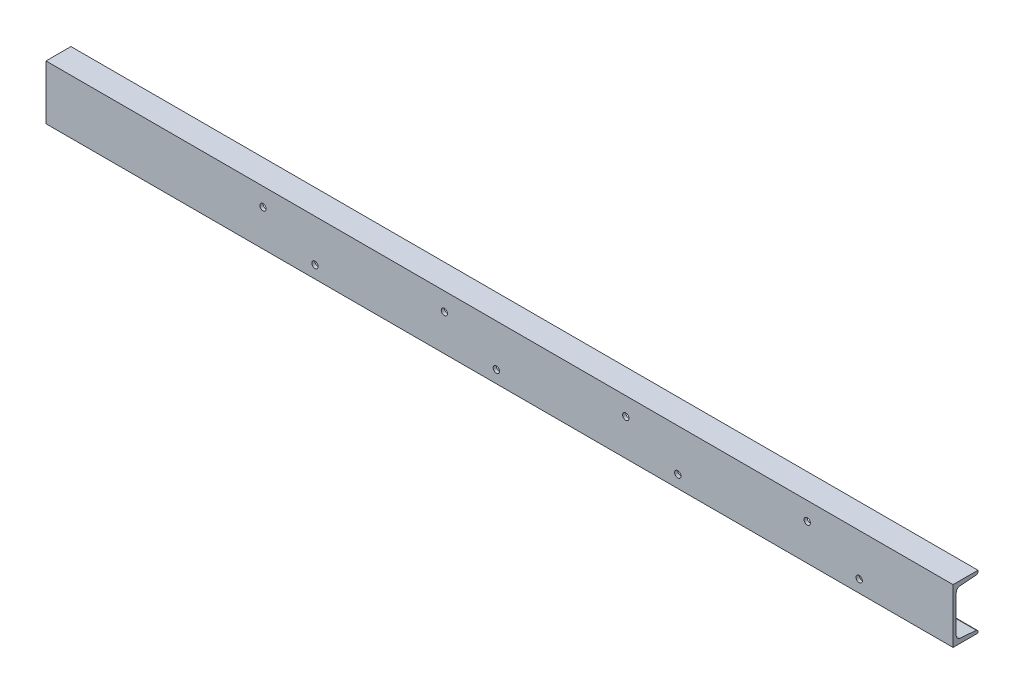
ISO-10303-21;
HEADER;
FILE_DESCRIPTION(('STEP AP214'),'2;1');
FILE_NAME('part.step','',(''),(''),'','','');
FILE_SCHEMA(('AUTOMOTIVE_DESIGN { 1 0 10303 214 1 1 1 1 }'));
ENDSEC;
DATA;
#1=APPLICATION_CONTEXT('core data for automotive mechanical design processes');
#2=APPLICATION_PROTOCOL_DEFINITION('international standard','automotive_design',2000,#1);
#3=PRODUCT_CONTEXT('',#1,'mechanical');
#4=PRODUCT('Part','Part','',(#3));
#5=PRODUCT_RELATED_PRODUCT_CATEGORY('part','',(#4));
#6=PRODUCT_DEFINITION_FORMATION('','',#4);
#7=PRODUCT_DEFINITION_CONTEXT('part definition',#1,'design');
#8=PRODUCT_DEFINITION('design','',#6,#7);
#9=PRODUCT_DEFINITION_SHAPE('','',#8);
#10=(LENGTH_UNIT() NAMED_UNIT(*) SI_UNIT(.MILLI.,.METRE.));
#11=(NAMED_UNIT(*) PLANE_ANGLE_UNIT() SI_UNIT($,.RADIAN.));
#12=(NAMED_UNIT(*) SI_UNIT($,.STERADIAN.) SOLID_ANGLE_UNIT());
#13=UNCERTAINTY_MEASURE_WITH_UNIT(LENGTH_MEASURE(1.E-05),#10,'distance_accuracy_value','');
#14=(GEOMETRIC_REPRESENTATION_CONTEXT(3) GLOBAL_UNCERTAINTY_ASSIGNED_CONTEXT((#13)) GLOBAL_UNIT_ASSIGNED_CONTEXT((#10,
#11,#12)) REPRESENTATION_CONTEXT('',''));
#15=CARTESIAN_POINT('',(0.,0.,0.));
#16=DIRECTION('',(0.,0.,1.));
#17=DIRECTION('',(1.,0.,0.));
#18=AXIS2_PLACEMENT_3D('',#15,#16,#17);
#19=CARTESIAN_POINT('',(2000.,-117.354409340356,-50.5000000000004));
#20=DIRECTION('',(-1.,0.,0.));
#21=DIRECTION('',(0.,0.,1.));
#22=AXIS2_PLACEMENT_3D('',#19,#20,#21);
#23=CYLINDRICAL_SURFACE('',#22,4.49999999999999);
#24=CARTESIAN_POINT('',(3.52639615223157E-13,-117.354409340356,-50.5000000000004));
#25=DIRECTION('',(-1.,0.,0.));
#26=DIRECTION('',(0.,0.,1.));
#27=AXIS2_PLACEMENT_3D('',#24,#25,#26);
#28=CIRCLE('',#27,4.49999999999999);
#29=CARTESIAN_POINT('',(3.55145518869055E-13,-112.868741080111,-50.8588596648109));
#30=VERTEX_POINT('',#29);
#31=CARTESIAN_POINT('',(3.84062947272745E-13,-117.354409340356,-55.0000000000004));
#32=VERTEX_POINT('',#31);
#33=EDGE_CURVE('E198',#30,#32,#28,.T.);
#34=ORIENTED_EDGE('',*,*,#33,.F.);
#35=DIRECTION('',(-1.,0.,0.));
#36=VECTOR('',#35,1.);
#37=CARTESIAN_POINT('',(2000.,-112.868741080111,-50.8588596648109));
#38=LINE('',#37,#36);
#39=CARTESIAN_POINT('',(2000.,-112.868741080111,-50.8588596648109));
#40=VERTEX_POINT('',#39);
#41=EDGE_CURVE('E13',#40,#30,#38,.T.);
#42=ORIENTED_EDGE('',*,*,#41,.F.);
#43=CARTESIAN_POINT('',(2000.,-117.354409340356,-50.5000000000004));
#44=DIRECTION('',(-1.,0.,0.));
#45=DIRECTION('',(0.,0.,1.));
#46=AXIS2_PLACEMENT_3D('',#43,#44,#45);
#47=CIRCLE('',#46,4.49999999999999);
#48=CARTESIAN_POINT('',(2000.,-117.354409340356,-55.0000000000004));
#49=VERTEX_POINT('',#48);
#50=EDGE_CURVE('E231',#40,#49,#47,.T.);
#51=ORIENTED_EDGE('',*,*,#50,.T.);
#52=DIRECTION('',(-1.,0.,0.));
#53=VECTOR('',#52,1.);
#54=CARTESIAN_POINT('',(2000.,-117.354409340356,-55.0000000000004));
#55=LINE('',#54,#53);
#56=EDGE_CURVE('E144',#49,#32,#55,.T.);
#57=ORIENTED_EDGE('',*,*,#56,.T.);
#58=EDGE_LOOP('',(#34,#42,#51,#57));
#59=FACE_BOUND('',#58,.T.);
#60=ADVANCED_FACE('F76',(#59),#23,.T.);
#61=CARTESIAN_POINT('',(2000.,-110.022565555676,-15.2822806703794));
#62=DIRECTION('',(0.,0.9968151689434,-0.0797465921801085));
#63=DIRECTION('',(0.,0.0797465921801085,0.9968151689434));
#64=AXIS2_PLACEMENT_3D('',#61,#62,#63);
#65=PLANE('',#64);
#66=DIRECTION('',(0.,-0.0797465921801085,-0.9968151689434));
#67=VECTOR('',#66,1.);
#68=CARTESIAN_POINT('',(1.06715595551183E-13,-110.022565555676,-15.2822806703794));
#69=LINE('',#68,#67);
#70=CARTESIAN_POINT('',(1.06715595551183E-13,-110.022565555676,-15.2822806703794));
#71=VERTEX_POINT('',#70);
#72=EDGE_CURVE('E229',#71,#30,#69,.T.);
#73=ORIENTED_EDGE('',*,*,#72,.F.);
#74=DIRECTION('',(-1.,0.,0.));
#75=VECTOR('',#74,1.);
#76=CARTESIAN_POINT('',(2000.,-110.022565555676,-15.2822806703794));
#77=LINE('',#76,#75);
#78=CARTESIAN_POINT('',(2000.,-110.022565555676,-15.2822806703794));
#79=VERTEX_POINT('',#78);
#80=EDGE_CURVE('E85',#79,#71,#77,.T.);
#81=ORIENTED_EDGE('',*,*,#80,.F.);
#82=DIRECTION('',(0.,-0.0797465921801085,-0.9968151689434));
#83=VECTOR('',#82,1.);
#84=CARTESIAN_POINT('',(2000.,-110.022565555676,-15.2822806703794));
#85=LINE('',#84,#83);
#86=EDGE_CURVE('E188',#79,#40,#85,.T.);
#87=ORIENTED_EDGE('',*,*,#86,.T.);
#88=ORIENTED_EDGE('',*,*,#41,.T.);
#89=EDGE_LOOP('',(#73,#81,#87,#88));
#90=FACE_BOUND('',#89,.T.);
#91=ADVANCED_FACE('F252',(#90),#65,.T.);
#92=CARTESIAN_POINT('',(2000.,-101.051229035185,-16.0000000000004));
#93=DIRECTION('',(-1.,0.,0.));
#94=DIRECTION('',(0.,0.,1.));
#95=AXIS2_PLACEMENT_3D('',#92,#93,#94);
#96=CYLINDRICAL_SURFACE('',#95,8.99999999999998);
#97=CARTESIAN_POINT('',(1.1172740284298E-13,-101.051229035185,-16.0000000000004));
#98=DIRECTION('',(1.,0.,0.));
#99=DIRECTION('',(0.,0.,-1.));
#100=AXIS2_PLACEMENT_3D('',#97,#98,#99);
#101=CIRCLE('',#100,8.99999999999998);
#102=CARTESIAN_POINT('',(0.,-101.051229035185,-7.00000000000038));
#103=VERTEX_POINT('',#102);
#104=EDGE_CURVE('E175',#103,#71,#101,.T.);
#105=ORIENTED_EDGE('',*,*,#104,.F.);
#106=DIRECTION('',(-1.,0.,0.));
#107=VECTOR('',#106,1.);
#108=CARTESIAN_POINT('',(2000.,-101.051229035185,-7.00000000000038));
#109=LINE('',#108,#107);
#110=CARTESIAN_POINT('',(2000.,-101.051229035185,-7.00000000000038));
#111=VERTEX_POINT('',#110);
#112=EDGE_CURVE('E170',#111,#103,#109,.T.);
#113=ORIENTED_EDGE('',*,*,#112,.F.);
#114=CARTESIAN_POINT('',(2000.,-101.051229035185,-16.0000000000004));
#115=DIRECTION('',(1.,0.,0.));
#116=DIRECTION('',(0.,0.,-1.));
#117=AXIS2_PLACEMENT_3D('',#114,#115,#116);
#118=CIRCLE('',#117,8.99999999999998);
#119=EDGE_CURVE('E173',#111,#79,#118,.T.);
#120=ORIENTED_EDGE('',*,*,#119,.T.);
#121=ORIENTED_EDGE('',*,*,#80,.T.);
#122=EDGE_LOOP('',(#105,#113,#120,#121));
#123=FACE_BOUND('',#122,.T.);
#124=ADVANCED_FACE('F172',(#123),#96,.F.);
#125=CARTESIAN_POINT('',(2000.,-101.051229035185,-7.00000000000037));
#126=DIRECTION('',(0.,0.,-1.));
#127=DIRECTION('',(0.,1.,0.));
#128=AXIS2_PLACEMENT_3D('',#125,#126,#127);
#129=PLANE('',#128);
#130=CARTESIAN_POINT('',(593.04300155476,-92.774396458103,-7.00000000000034));
#131=DIRECTION('',(0.,0.,-1.));
#132=DIRECTION('',(0.,1.,0.));
#133=AXIS2_PLACEMENT_3D('',#130,#131,#132);
#134=CIRCLE('',#133,7.00000000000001);
#135=CARTESIAN_POINT('',(593.04300155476,-85.774396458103,-7.00000000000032));
#136=VERTEX_POINT('',#135);
#137=EDGE_CURVE('E340',#136,#136,#134,.T.);
#138=ORIENTED_EDGE('',*,*,#137,.F.);
#139=EDGE_LOOP('',(#138));
#140=FACE_BOUND('',#139,.T.);
#141=CARTESIAN_POINT('',(993.04300155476,-92.774396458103,-7.00000000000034));
#142=DIRECTION('',(0.,0.,-1.));
#143=DIRECTION('',(0.,1.,0.));
#144=AXIS2_PLACEMENT_3D('',#141,#142,#143);
#145=CIRCLE('',#144,6.9999999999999);
#146=CARTESIAN_POINT('',(993.04300155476,-85.7743964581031,-7.00000000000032));
#147=VERTEX_POINT('',#146);
#148=EDGE_CURVE('E344',#147,#147,#145,.T.);
#149=ORIENTED_EDGE('',*,*,#148,.F.);
#150=EDGE_LOOP('',(#149));
#151=FACE_BOUND('',#150,.T.);
#152=CARTESIAN_POINT('',(1393.04300155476,-92.774396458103,-7.00000000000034));
#153=DIRECTION('',(0.,0.,-1.));
#154=DIRECTION('',(0.,1.,0.));
#155=AXIS2_PLACEMENT_3D('',#152,#153,#154);
#156=CIRCLE('',#155,6.9999999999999);
#157=CARTESIAN_POINT('',(1393.04300155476,-85.7743964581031,-7.00000000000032));
#158=VERTEX_POINT('',#157);
#159=EDGE_CURVE('E353',#158,#158,#156,.T.);
#160=ORIENTED_EDGE('',*,*,#159,.F.);
#161=EDGE_LOOP('',(#160));
#162=FACE_BOUND('',#161,.T.);
#163=CARTESIAN_POINT('',(1793.04300155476,-92.774396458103,-7.00000000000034));
#164=DIRECTION('',(0.,0.,-1.));
#165=DIRECTION('',(0.,1.,0.));
#166=AXIS2_PLACEMENT_3D('',#163,#164,#165);
#167=CIRCLE('',#166,6.9999999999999);
#168=CARTESIAN_POINT('',(1793.04300155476,-85.7743964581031,-7.00000000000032));
#169=VERTEX_POINT('',#168);
#170=EDGE_CURVE('E359',#169,#169,#167,.T.);
#171=ORIENTED_EDGE('',*,*,#170,.F.);
#172=EDGE_LOOP('',(#171));
#173=FACE_BOUND('',#172,.T.);
#174=CARTESIAN_POINT('',(478.466142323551,-39.9999999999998,-7.00000000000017));
#175=DIRECTION('',(0.,0.,-1.));
#176=DIRECTION('',(0.,1.,0.));
#177=AXIS2_PLACEMENT_3D('',#174,#175,#176);
#178=CIRCLE('',#177,7.00000000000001);
#179=CARTESIAN_POINT('',(478.466142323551,-32.9999999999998,-7.00000000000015));
#180=VERTEX_POINT('',#179);
#181=EDGE_CURVE('E365',#180,#180,#178,.T.);
#182=ORIENTED_EDGE('',*,*,#181,.F.);
#183=EDGE_LOOP('',(#182));
#184=FACE_BOUND('',#183,.T.);
#185=CARTESIAN_POINT('',(878.466142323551,-39.9999999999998,-7.00000000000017));
#186=DIRECTION('',(0.,0.,-1.));
#187=DIRECTION('',(0.,1.,0.));
#188=AXIS2_PLACEMENT_3D('',#185,#186,#187);
#189=CIRCLE('',#188,7.00000000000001);
#190=CARTESIAN_POINT('',(878.466142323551,-32.9999999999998,-7.00000000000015));
#191=VERTEX_POINT('',#190);
#192=EDGE_CURVE('E371',#191,#191,#189,.T.);
#193=ORIENTED_EDGE('',*,*,#192,.F.);
#194=EDGE_LOOP('',(#193));
#195=FACE_BOUND('',#194,.T.);
#196=CARTESIAN_POINT('',(1278.46614232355,-39.9999999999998,-7.00000000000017));
#197=DIRECTION('',(0.,0.,-1.));
#198=DIRECTION('',(0.,1.,0.));
#199=AXIS2_PLACEMENT_3D('',#196,#197,#198);
#200=CIRCLE('',#199,6.9999999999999);
#201=CARTESIAN_POINT('',(1278.46614232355,-32.9999999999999,-7.00000000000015));
#202=VERTEX_POINT('',#201);
#203=EDGE_CURVE('E79',#202,#202,#200,.T.);
#204=ORIENTED_EDGE('',*,*,#203,.F.);
#205=EDGE_LOOP('',(#204));
#206=FACE_BOUND('',#205,.T.);
#207=CARTESIAN_POINT('',(1678.46614232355,-39.9999999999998,-7.00000000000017));
#208=DIRECTION('',(0.,0.,-1.));
#209=DIRECTION('',(0.,1.,0.));
#210=AXIS2_PLACEMENT_3D('',#207,#208,#209);
#211=CIRCLE('',#210,6.9999999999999);
#212=CARTESIAN_POINT('',(1678.46614232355,-32.9999999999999,-7.00000000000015));
#213=VERTEX_POINT('',#212);
#214=EDGE_CURVE('E202',#213,#213,#211,.T.);
#215=ORIENTED_EDGE('',*,*,#214,.F.);
#216=EDGE_LOOP('',(#215));
#217=FACE_BOUND('',#216,.T.);
#218=DIRECTION('',(0.,-1.,0.));
#219=VECTOR('',#218,1.);
#220=CARTESIAN_POINT('',(0.,-101.051229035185,-7.00000000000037));
#221=LINE('',#220,#219);
#222=CARTESIAN_POINT('',(0.,-18.948770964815,-7.00000000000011));
#223=VERTEX_POINT('',#222);
#224=EDGE_CURVE('E226',#223,#103,#221,.T.);
#225=ORIENTED_EDGE('',*,*,#224,.F.);
#226=DIRECTION('',(-1.,0.,0.));
#227=VECTOR('',#226,1.);
#228=CARTESIAN_POINT('',(2000.,-18.948770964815,-7.00000000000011));
#229=LINE('',#228,#227);
#230=CARTESIAN_POINT('',(2000.,-18.948770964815,-7.00000000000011));
#231=VERTEX_POINT('',#230);
#232=EDGE_CURVE('E180',#231,#223,#229,.T.);
#233=ORIENTED_EDGE('',*,*,#232,.F.);
#234=DIRECTION('',(0.,-1.,0.));
#235=VECTOR('',#234,1.);
#236=CARTESIAN_POINT('',(2000.,-101.051229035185,-7.00000000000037));
#237=LINE('',#236,#235);
#238=EDGE_CURVE('E186',#231,#111,#237,.T.);
#239=ORIENTED_EDGE('',*,*,#238,.T.);
#240=ORIENTED_EDGE('',*,*,#112,.T.);
#241=EDGE_LOOP('',(#225,#233,#239,#240));
#242=FACE_BOUND('',#241,.T.);
#243=ADVANCED_FACE('F190',(#140,#151,#162,#173,#184,#195,#206,#217,#242),#129,.T.);
#244=CARTESIAN_POINT('',(2000.,-18.948770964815,-16.0000000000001));
#245=DIRECTION('',(-1.,0.,0.));
#246=DIRECTION('',(0.,0.,1.));
#247=AXIS2_PLACEMENT_3D('',#244,#245,#246);
#248=CYLINDRICAL_SURFACE('',#247,8.99999999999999);
#249=CARTESIAN_POINT('',(1.11727402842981E-13,-18.948770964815,-16.0000000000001));
#250=DIRECTION('',(1.,0.,0.));
#251=DIRECTION('',(0.,0.,1.));
#252=AXIS2_PLACEMENT_3D('',#249,#250,#251);
#253=CIRCLE('',#252,8.99999999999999);
#254=CARTESIAN_POINT('',(1.06715595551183E-13,-9.97743444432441,-15.282280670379));
#255=VERTEX_POINT('',#254);
#256=EDGE_CURVE('E223',#255,#223,#253,.T.);
#257=ORIENTED_EDGE('',*,*,#256,.F.);
#258=DIRECTION('',(-1.,0.,0.));
#259=VECTOR('',#258,1.);
#260=CARTESIAN_POINT('',(2000.,-9.97743444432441,-15.282280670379));
#261=LINE('',#260,#259);
#262=CARTESIAN_POINT('',(2000.,-9.97743444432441,-15.282280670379));
#263=VERTEX_POINT('',#262);
#264=EDGE_CURVE('E235',#263,#255,#261,.T.);
#265=ORIENTED_EDGE('',*,*,#264,.F.);
#266=CARTESIAN_POINT('',(2000.,-18.948770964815,-16.0000000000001));
#267=DIRECTION('',(1.,0.,0.));
#268=DIRECTION('',(0.,0.,1.));
#269=AXIS2_PLACEMENT_3D('',#266,#267,#268);
#270=CIRCLE('',#269,8.99999999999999);
#271=EDGE_CURVE('E191',#263,#231,#270,.T.);
#272=ORIENTED_EDGE('',*,*,#271,.T.);
#273=ORIENTED_EDGE('',*,*,#232,.T.);
#274=EDGE_LOOP('',(#257,#265,#272,#273));
#275=FACE_BOUND('',#274,.T.);
#276=ADVANCED_FACE('F265',(#275),#248,.F.);
#277=CARTESIAN_POINT('',(2000.,-9.97743444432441,-15.282280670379));
#278=DIRECTION('',(0.,-0.996815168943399,-0.0797465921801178));
#279=DIRECTION('',(0.,0.0797465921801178,-0.996815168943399));
#280=AXIS2_PLACEMENT_3D('',#277,#278,#279);
#281=PLANE('',#280);
#282=DIRECTION('',(0.,-0.0797465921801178,0.996815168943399));
#283=VECTOR('',#282,1.);
#284=CARTESIAN_POINT('',(1.06715595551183E-13,-9.97743444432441,-15.282280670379));
#285=LINE('',#284,#283);
#286=CARTESIAN_POINT('',(3.55145518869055E-13,-7.13125891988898,-50.8588596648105));
#287=VERTEX_POINT('',#286);
#288=EDGE_CURVE('E220',#287,#255,#285,.T.);
#289=ORIENTED_EDGE('',*,*,#288,.F.);
#290=DIRECTION('',(-1.,0.,0.));
#291=VECTOR('',#290,1.);
#292=CARTESIAN_POINT('',(2000.,-7.13125891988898,-50.8588596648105));
#293=LINE('',#292,#291);
#294=CARTESIAN_POINT('',(2000.,-7.13125891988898,-50.8588596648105));
#295=VERTEX_POINT('',#294);
#296=EDGE_CURVE('E237',#295,#287,#293,.T.);
#297=ORIENTED_EDGE('',*,*,#296,.F.);
#298=DIRECTION('',(0.,-0.0797465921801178,0.996815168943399));
#299=VECTOR('',#298,1.);
#300=CARTESIAN_POINT('',(2000.,-9.97743444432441,-15.282280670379));
#301=LINE('',#300,#299);
#302=EDGE_CURVE('E193',#295,#263,#301,.T.);
#303=ORIENTED_EDGE('',*,*,#302,.T.);
#304=ORIENTED_EDGE('',*,*,#264,.T.);
#305=EDGE_LOOP('',(#289,#297,#303,#304));
#306=FACE_BOUND('',#305,.T.);
#307=ADVANCED_FACE('F269',(#306),#281,.T.);
#308=CARTESIAN_POINT('',(2000.,-2.64559065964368,-50.5));
#309=DIRECTION('',(-1.,0.,0.));
#310=DIRECTION('',(0.,0.,1.));
#311=AXIS2_PLACEMENT_3D('',#308,#309,#310);
#312=CYLINDRICAL_SURFACE('',#311,4.5);
#313=CARTESIAN_POINT('',(3.52639615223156E-13,-2.64559065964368,-50.5));
#314=DIRECTION('',(-1.,0.,0.));
#315=DIRECTION('',(0.,0.,-1.));
#316=AXIS2_PLACEMENT_3D('',#313,#314,#315);
#317=CIRCLE('',#316,4.5);
#318=CARTESIAN_POINT('',(3.84062947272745E-13,-2.64559065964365,-55.));
#319=VERTEX_POINT('',#318);
#320=EDGE_CURVE('E217',#319,#287,#317,.T.);
#321=ORIENTED_EDGE('',*,*,#320,.F.);
#322=DIRECTION('',(-1.,0.,0.));
#323=VECTOR('',#322,1.);
#324=CARTESIAN_POINT('',(2000.,-2.64559065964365,-55.));
#325=LINE('',#324,#323);
#326=CARTESIAN_POINT('',(2000.,-2.64559065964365,-55.));
#327=VERTEX_POINT('',#326);
#328=EDGE_CURVE('E239',#327,#319,#325,.T.);
#329=ORIENTED_EDGE('',*,*,#328,.F.);
#330=CARTESIAN_POINT('',(2000.,-2.64559065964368,-50.5));
#331=DIRECTION('',(-1.,0.,0.));
#332=DIRECTION('',(0.,0.,-1.));
#333=AXIS2_PLACEMENT_3D('',#330,#331,#332);
#334=CIRCLE('',#333,4.5);
#335=EDGE_CURVE('E397',#327,#295,#334,.T.);
#336=ORIENTED_EDGE('',*,*,#335,.T.);
#337=ORIENTED_EDGE('',*,*,#296,.T.);
#338=EDGE_LOOP('',(#321,#329,#336,#337));
#339=FACE_BOUND('',#338,.T.);
#340=ADVANCED_FACE('F273',(#339),#312,.T.);
#341=CARTESIAN_POINT('',(2000.,1.96195468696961E-13,-55.));
#342=DIRECTION('',(0.,0.,-1.));
#343=DIRECTION('',(0.,1.,0.));
#344=AXIS2_PLACEMENT_3D('',#341,#342,#343);
#345=PLANE('',#344);
#346=DIRECTION('',(0.,-1.,0.));
#347=VECTOR('',#346,1.);
#348=CARTESIAN_POINT('',(3.84062947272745E-13,1.96195468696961E-13,-55.));
#349=LINE('',#348,#347);
#350=CARTESIAN_POINT('',(3.84062947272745E-13,1.96195468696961E-13,-55.));
#351=VERTEX_POINT('',#350);
#352=EDGE_CURVE('E214',#351,#319,#349,.T.);
#353=ORIENTED_EDGE('',*,*,#352,.F.);
#354=DIRECTION('',(-1.,0.,0.));
#355=VECTOR('',#354,1.);
#356=CARTESIAN_POINT('',(2000.,1.96195468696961E-13,-55.));
#357=LINE('',#356,#355);
#358=CARTESIAN_POINT('',(2000.,1.96195468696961E-13,-55.));
#359=VERTEX_POINT('',#358);
#360=EDGE_CURVE('E241',#359,#351,#357,.T.);
#361=ORIENTED_EDGE('',*,*,#360,.F.);
#362=DIRECTION('',(0.,-1.,0.));
#363=VECTOR('',#362,1.);
#364=CARTESIAN_POINT('',(2000.,1.96195468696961E-13,-55.));
#365=LINE('',#364,#363);
#366=EDGE_CURVE('E394',#359,#327,#365,.T.);
#367=ORIENTED_EDGE('',*,*,#366,.T.);
#368=ORIENTED_EDGE('',*,*,#328,.T.);
#369=EDGE_LOOP('',(#353,#361,#367,#368));
#370=FACE_BOUND('',#369,.T.);
#371=ADVANCED_FACE('F277',(#370),#345,.T.);
#372=CARTESIAN_POINT('',(2000.,1.96195468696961E-13,-55.));
#373=DIRECTION('',(0.,1.,0.));
#374=DIRECTION('',(0.,0.,1.));
#375=AXIS2_PLACEMENT_3D('',#372,#373,#374);
#376=PLANE('',#375);
#377=DIRECTION('',(0.,0.,-1.));
#378=VECTOR('',#377,1.);
#379=CARTESIAN_POINT('',(3.84062947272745E-13,1.96195468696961E-13,-55.));
#380=LINE('',#379,#378);
#381=CARTESIAN_POINT('',(0.,0.,0.));
#382=VERTEX_POINT('',#381);
#383=EDGE_CURVE('E211',#382,#351,#380,.T.);
#384=ORIENTED_EDGE('',*,*,#383,.F.);
#385=DIRECTION('',(-1.,0.,0.));
#386=VECTOR('',#385,1.);
#387=CARTESIAN_POINT('',(2000.,0.,0.));
#388=LINE('',#387,#386);
#389=CARTESIAN_POINT('',(2000.,0.,0.));
#390=VERTEX_POINT('',#389);
#391=EDGE_CURVE('E243',#390,#382,#388,.T.);
#392=ORIENTED_EDGE('',*,*,#391,.F.);
#393=DIRECTION('',(0.,0.,-1.));
#394=VECTOR('',#393,1.);
#395=CARTESIAN_POINT('',(2000.,1.96195468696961E-13,-55.));
#396=LINE('',#395,#394);
#397=EDGE_CURVE('E391',#390,#359,#396,.T.);
#398=ORIENTED_EDGE('',*,*,#397,.T.);
#399=ORIENTED_EDGE('',*,*,#360,.T.);
#400=EDGE_LOOP('',(#384,#392,#398,#399));
#401=FACE_BOUND('',#400,.T.);
#402=ADVANCED_FACE('F281',(#401),#376,.T.);
#403=CARTESIAN_POINT('',(2000.,-120.,-4.18977760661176E-13));
#404=DIRECTION('',(0.,0.,1.));
#405=DIRECTION('',(0.,-1.,0.));
#406=AXIS2_PLACEMENT_3D('',#403,#404,#405);
#407=PLANE('',#406);
#408=CARTESIAN_POINT('',(593.04300155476,-92.774396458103,-1.83562771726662E-13));
#409=DIRECTION('',(0.,0.,1.));
#410=DIRECTION('',(1.,0.,0.));
#411=AXIS2_PLACEMENT_3D('',#408,#409,#410);
#412=CIRCLE('',#411,7.00000000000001);
#413=CARTESIAN_POINT('',(600.04300155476,-92.774396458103,-1.83562771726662E-13));
#414=VERTEX_POINT('',#413);
#415=EDGE_CURVE('E337',#414,#414,#412,.T.);
#416=ORIENTED_EDGE('',*,*,#415,.F.);
#417=EDGE_LOOP('',(#416));
#418=FACE_BOUND('',#417,.T.);
#419=CARTESIAN_POINT('',(993.04300155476,-92.774396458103,-1.83562771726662E-13));
#420=DIRECTION('',(0.,0.,1.));
#421=DIRECTION('',(1.,0.,0.));
#422=AXIS2_PLACEMENT_3D('',#419,#420,#421);
#423=CIRCLE('',#422,6.9999999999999);
#424=CARTESIAN_POINT('',(1000.04300155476,-92.774396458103,-1.83562771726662E-13));
#425=VERTEX_POINT('',#424);
#426=EDGE_CURVE('E341',#425,#425,#423,.T.);
#427=ORIENTED_EDGE('',*,*,#426,.F.);
#428=EDGE_LOOP('',(#427));
#429=FACE_BOUND('',#428,.T.);
#430=CARTESIAN_POINT('',(1393.04300155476,-92.774396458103,-1.83562771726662E-13));
#431=DIRECTION('',(0.,0.,1.));
#432=DIRECTION('',(1.,0.,0.));
#433=AXIS2_PLACEMENT_3D('',#430,#431,#432);
#434=CIRCLE('',#433,6.9999999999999);
#435=CARTESIAN_POINT('',(1400.04300155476,-92.774396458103,-1.83562771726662E-13));
#436=VERTEX_POINT('',#435);
#437=EDGE_CURVE('E350',#436,#436,#434,.T.);
#438=ORIENTED_EDGE('',*,*,#437,.F.);
#439=EDGE_LOOP('',(#438));
#440=FACE_BOUND('',#439,.T.);
#441=CARTESIAN_POINT('',(1793.04300155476,-92.774396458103,-1.83562771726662E-13));
#442=DIRECTION('',(0.,0.,1.));
#443=DIRECTION('',(1.,0.,0.));
#444=AXIS2_PLACEMENT_3D('',#441,#442,#443);
#445=CIRCLE('',#444,6.9999999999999);
#446=CARTESIAN_POINT('',(1800.04300155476,-92.774396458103,-1.83562771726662E-13));
#447=VERTEX_POINT('',#446);
#448=EDGE_CURVE('E356',#447,#447,#445,.T.);
#449=ORIENTED_EDGE('',*,*,#448,.F.);
#450=EDGE_LOOP('',(#449));
#451=FACE_BOUND('',#450,.T.);
#452=CARTESIAN_POINT('',(478.466142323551,-39.9999999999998,0.));
#453=DIRECTION('',(0.,0.,1.));
#454=DIRECTION('',(1.,0.,0.));
#455=AXIS2_PLACEMENT_3D('',#452,#453,#454);
#456=CIRCLE('',#455,7.00000000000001);
#457=CARTESIAN_POINT('',(485.466142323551,-39.9999999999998,0.));
#458=VERTEX_POINT('',#457);
#459=EDGE_CURVE('E362',#458,#458,#456,.T.);
#460=ORIENTED_EDGE('',*,*,#459,.F.);
#461=EDGE_LOOP('',(#460));
#462=FACE_BOUND('',#461,.T.);
#463=CARTESIAN_POINT('',(878.466142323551,-39.9999999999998,0.));
#464=DIRECTION('',(0.,0.,1.));
#465=DIRECTION('',(1.,0.,0.));
#466=AXIS2_PLACEMENT_3D('',#463,#464,#465);
#467=CIRCLE('',#466,7.00000000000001);
#468=CARTESIAN_POINT('',(885.466142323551,-39.9999999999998,0.));
#469=VERTEX_POINT('',#468);
#470=EDGE_CURVE('E368',#469,#469,#467,.T.);
#471=ORIENTED_EDGE('',*,*,#470,.F.);
#472=EDGE_LOOP('',(#471));
#473=FACE_BOUND('',#472,.T.);
#474=CARTESIAN_POINT('',(1278.46614232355,-39.9999999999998,0.));
#475=DIRECTION('',(0.,0.,1.));
#476=DIRECTION('',(1.,0.,0.));
#477=AXIS2_PLACEMENT_3D('',#474,#475,#476);
#478=CIRCLE('',#477,6.9999999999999);
#479=CARTESIAN_POINT('',(1285.46614232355,-39.9999999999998,0.));
#480=VERTEX_POINT('',#479);
#481=EDGE_CURVE('E374',#480,#480,#478,.T.);
#482=ORIENTED_EDGE('',*,*,#481,.F.);
#483=EDGE_LOOP('',(#482));
#484=FACE_BOUND('',#483,.T.);
#485=CARTESIAN_POINT('',(1678.46614232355,-39.9999999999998,0.));
#486=DIRECTION('',(0.,0.,1.));
#487=DIRECTION('',(1.,0.,0.));
#488=AXIS2_PLACEMENT_3D('',#485,#486,#487);
#489=CIRCLE('',#488,6.9999999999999);
#490=CARTESIAN_POINT('',(1685.46614232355,-39.9999999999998,0.));
#491=VERTEX_POINT('',#490);
#492=EDGE_CURVE('E377',#491,#491,#489,.T.);
#493=ORIENTED_EDGE('',*,*,#492,.F.);
#494=EDGE_LOOP('',(#493));
#495=FACE_BOUND('',#494,.T.);
#496=DIRECTION('',(0.,1.,0.));
#497=VECTOR('',#496,1.);
#498=CARTESIAN_POINT('',(0.,-120.,-4.18977760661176E-13));
#499=LINE('',#498,#497);
#500=CARTESIAN_POINT('',(0.,-120.,-4.18977760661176E-13));
#501=VERTEX_POINT('',#500);
#502=EDGE_CURVE('E208',#501,#382,#499,.T.);
#503=ORIENTED_EDGE('',*,*,#502,.F.);
#504=DIRECTION('',(-1.,0.,0.));
#505=VECTOR('',#504,1.);
#506=CARTESIAN_POINT('',(2000.,-120.,-4.18977760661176E-13));
#507=LINE('',#506,#505);
#508=CARTESIAN_POINT('',(2000.,-120.,-4.18977760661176E-13));
#509=VERTEX_POINT('',#508);
#510=EDGE_CURVE('E245',#509,#501,#507,.T.);
#511=ORIENTED_EDGE('',*,*,#510,.F.);
#512=DIRECTION('',(0.,1.,0.));
#513=VECTOR('',#512,1.);
#514=CARTESIAN_POINT('',(2000.,-120.,-4.18977760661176E-13));
#515=LINE('',#514,#513);
#516=EDGE_CURVE('E388',#509,#390,#515,.T.);
#517=ORIENTED_EDGE('',*,*,#516,.T.);
#518=ORIENTED_EDGE('',*,*,#391,.T.);
#519=EDGE_LOOP('',(#503,#511,#517,#518));
#520=FACE_BOUND('',#519,.T.);
#521=ADVANCED_FACE('F285',(#418,#429,#440,#451,#462,#473,#484,#495,#520),#407,.T.);
#522=CARTESIAN_POINT('',(2000.,-120.,-55.0000000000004));
#523=DIRECTION('',(0.,-1.,0.));
#524=DIRECTION('',(0.,0.,-1.));
#525=AXIS2_PLACEMENT_3D('',#522,#523,#524);
#526=PLANE('',#525);
#527=DIRECTION('',(0.,0.,1.));
#528=VECTOR('',#527,1.);
#529=CARTESIAN_POINT('',(3.84062947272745E-13,-120.,-55.0000000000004));
#530=LINE('',#529,#528);
#531=CARTESIAN_POINT('',(3.84062947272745E-13,-120.,-55.0000000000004));
#532=VERTEX_POINT('',#531);
#533=EDGE_CURVE('E205',#532,#501,#530,.T.);
#534=ORIENTED_EDGE('',*,*,#533,.F.);
#535=DIRECTION('',(-1.,0.,0.));
#536=VECTOR('',#535,1.);
#537=CARTESIAN_POINT('',(2000.,-120.,-55.0000000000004));
#538=LINE('',#537,#536);
#539=CARTESIAN_POINT('',(2000.,-120.,-55.0000000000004));
#540=VERTEX_POINT('',#539);
#541=EDGE_CURVE('E247',#540,#532,#538,.T.);
#542=ORIENTED_EDGE('',*,*,#541,.F.);
#543=DIRECTION('',(0.,0.,1.));
#544=VECTOR('',#543,1.);
#545=CARTESIAN_POINT('',(2000.,-120.,-55.0000000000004));
#546=LINE('',#545,#544);
#547=EDGE_CURVE('E385',#540,#509,#546,.T.);
#548=ORIENTED_EDGE('',*,*,#547,.T.);
#549=ORIENTED_EDGE('',*,*,#510,.T.);
#550=EDGE_LOOP('',(#534,#542,#548,#549));
#551=FACE_BOUND('',#550,.T.);
#552=ADVANCED_FACE('F289',(#551),#526,.T.);
#553=CARTESIAN_POINT('',(2000.,-120.,-55.0000000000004));
#554=DIRECTION('',(0.,0.,-1.));
#555=DIRECTION('',(0.,1.,0.));
#556=AXIS2_PLACEMENT_3D('',#553,#554,#555);
#557=PLANE('',#556);
#558=DIRECTION('',(0.,-1.,0.));
#559=VECTOR('',#558,1.);
#560=CARTESIAN_POINT('',(3.84062947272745E-13,-120.,-55.0000000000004));
#561=LINE('',#560,#559);
#562=EDGE_CURVE('E201',#32,#532,#561,.T.);
#563=ORIENTED_EDGE('',*,*,#562,.F.);
#564=ORIENTED_EDGE('',*,*,#56,.F.);
#565=DIRECTION('',(0.,-1.,0.));
#566=VECTOR('',#565,1.);
#567=CARTESIAN_POINT('',(2000.,-120.,-55.0000000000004));
#568=LINE('',#567,#566);
#569=EDGE_CURVE('E383',#49,#540,#568,.T.);
#570=ORIENTED_EDGE('',*,*,#569,.T.);
#571=ORIENTED_EDGE('',*,*,#541,.T.);
#572=EDGE_LOOP('',(#563,#564,#570,#571));
#573=FACE_BOUND('',#572,.T.);
#574=ADVANCED_FACE('F248',(#573),#557,.T.);
#575=CARTESIAN_POINT('',(2000.,-117.354409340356,-50.5000000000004));
#576=DIRECTION('',(-1.,0.,0.));
#577=DIRECTION('',(0.,0.,1.));
#578=AXIS2_PLACEMENT_3D('',#575,#576,#577);
#579=PLANE('',#578);
#580=ORIENTED_EDGE('',*,*,#50,.F.);
#581=ORIENTED_EDGE('',*,*,#86,.F.);
#582=ORIENTED_EDGE('',*,*,#119,.F.);
#583=ORIENTED_EDGE('',*,*,#238,.F.);
#584=ORIENTED_EDGE('',*,*,#271,.F.);
#585=ORIENTED_EDGE('',*,*,#302,.F.);
#586=ORIENTED_EDGE('',*,*,#335,.F.);
#587=ORIENTED_EDGE('',*,*,#366,.F.);
#588=ORIENTED_EDGE('',*,*,#397,.F.);
#589=ORIENTED_EDGE('',*,*,#516,.F.);
#590=ORIENTED_EDGE('',*,*,#547,.F.);
#591=ORIENTED_EDGE('',*,*,#569,.F.);
#592=EDGE_LOOP('',(#580,#581,#582,#583,#584,#585,#586,#587,#588,#589,#590,#591));
#593=FACE_BOUND('',#592,.T.);
#594=ADVANCED_FACE('F184',(#593),#579,.F.);
#595=CARTESIAN_POINT('',(3.52639615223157E-13,-117.354409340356,-50.5000000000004));
#596=DIRECTION('',(-1.,0.,0.));
#597=DIRECTION('',(0.,0.,1.));
#598=AXIS2_PLACEMENT_3D('',#595,#596,#597);
#599=PLANE('',#598);
#600=ORIENTED_EDGE('',*,*,#33,.T.);
#601=ORIENTED_EDGE('',*,*,#562,.T.);
#602=ORIENTED_EDGE('',*,*,#533,.T.);
#603=ORIENTED_EDGE('',*,*,#502,.T.);
#604=ORIENTED_EDGE('',*,*,#383,.T.);
#605=ORIENTED_EDGE('',*,*,#352,.T.);
#606=ORIENTED_EDGE('',*,*,#320,.T.);
#607=ORIENTED_EDGE('',*,*,#288,.T.);
#608=ORIENTED_EDGE('',*,*,#256,.T.);
#609=ORIENTED_EDGE('',*,*,#224,.T.);
#610=ORIENTED_EDGE('',*,*,#104,.T.);
#611=ORIENTED_EDGE('',*,*,#72,.T.);
#612=EDGE_LOOP('',(#600,#601,#602,#603,#604,#605,#606,#607,#608,#609,#610,#611));
#613=FACE_BOUND('',#612,.T.);
#614=ADVANCED_FACE('F251',(#613),#599,.T.);
#615=CARTESIAN_POINT('',(1678.46614232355,-39.9999999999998,0.));
#616=DIRECTION('',(0.,0.,1.));
#617=DIRECTION('',(1.,0.,0.));
#618=AXIS2_PLACEMENT_3D('',#615,#616,#617);
#619=CYLINDRICAL_SURFACE('',#618,6.9999999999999);
#620=ORIENTED_EDGE('',*,*,#214,.T.);
#621=EDGE_LOOP('',(#620));
#622=FACE_BOUND('',#621,.T.);
#623=ORIENTED_EDGE('',*,*,#492,.T.);
#624=EDGE_LOOP('',(#623));
#625=FACE_BOUND('',#624,.T.);
#626=ADVANCED_FACE('F300',(#622,#625),#619,.F.);
#627=CARTESIAN_POINT('',(1278.46614232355,-39.9999999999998,0.));
#628=DIRECTION('',(0.,0.,1.));
#629=DIRECTION('',(1.,0.,0.));
#630=AXIS2_PLACEMENT_3D('',#627,#628,#629);
#631=CYLINDRICAL_SURFACE('',#630,6.9999999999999);
#632=ORIENTED_EDGE('',*,*,#203,.T.);
#633=EDGE_LOOP('',(#632));
#634=FACE_BOUND('',#633,.T.);
#635=ORIENTED_EDGE('',*,*,#481,.T.);
#636=EDGE_LOOP('',(#635));
#637=FACE_BOUND('',#636,.T.);
#638=ADVANCED_FACE('F304',(#634,#637),#631,.F.);
#639=CARTESIAN_POINT('',(878.466142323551,-39.9999999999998,0.));
#640=DIRECTION('',(0.,0.,1.));
#641=DIRECTION('',(1.,0.,0.));
#642=AXIS2_PLACEMENT_3D('',#639,#640,#641);
#643=CYLINDRICAL_SURFACE('',#642,7.00000000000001);
#644=ORIENTED_EDGE('',*,*,#192,.T.);
#645=EDGE_LOOP('',(#644));
#646=FACE_BOUND('',#645,.T.);
#647=ORIENTED_EDGE('',*,*,#470,.T.);
#648=EDGE_LOOP('',(#647));
#649=FACE_BOUND('',#648,.T.);
#650=ADVANCED_FACE('F308',(#646,#649),#643,.F.);
#651=CARTESIAN_POINT('',(478.466142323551,-39.9999999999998,0.));
#652=DIRECTION('',(0.,0.,1.));
#653=DIRECTION('',(1.,0.,0.));
#654=AXIS2_PLACEMENT_3D('',#651,#652,#653);
#655=CYLINDRICAL_SURFACE('',#654,7.00000000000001);
#656=ORIENTED_EDGE('',*,*,#181,.T.);
#657=EDGE_LOOP('',(#656));
#658=FACE_BOUND('',#657,.T.);
#659=ORIENTED_EDGE('',*,*,#459,.T.);
#660=EDGE_LOOP('',(#659));
#661=FACE_BOUND('',#660,.T.);
#662=ADVANCED_FACE('F312',(#658,#661),#655,.F.);
#663=CARTESIAN_POINT('',(1793.04300155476,-92.774396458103,-1.84260820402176E-13));
#664=DIRECTION('',(0.,0.,1.));
#665=DIRECTION('',(1.,0.,0.));
#666=AXIS2_PLACEMENT_3D('',#663,#664,#665);
#667=CYLINDRICAL_SURFACE('',#666,6.9999999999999);
#668=ORIENTED_EDGE('',*,*,#448,.T.);
#669=EDGE_LOOP('',(#668));
#670=FACE_BOUND('',#669,.T.);
#671=ORIENTED_EDGE('',*,*,#170,.T.);
#672=EDGE_LOOP('',(#671));
#673=FACE_BOUND('',#672,.T.);
#674=ADVANCED_FACE('F316',(#670,#673),#667,.F.);
#675=CARTESIAN_POINT('',(1393.04300155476,-92.774396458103,-1.84260820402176E-13));
#676=DIRECTION('',(0.,0.,1.));
#677=DIRECTION('',(1.,0.,0.));
#678=AXIS2_PLACEMENT_3D('',#675,#676,#677);
#679=CYLINDRICAL_SURFACE('',#678,6.9999999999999);
#680=ORIENTED_EDGE('',*,*,#437,.T.);
#681=EDGE_LOOP('',(#680));
#682=FACE_BOUND('',#681,.T.);
#683=ORIENTED_EDGE('',*,*,#159,.T.);
#684=EDGE_LOOP('',(#683));
#685=FACE_BOUND('',#684,.T.);
#686=ADVANCED_FACE('F320',(#682,#685),#679,.F.);
#687=CARTESIAN_POINT('',(993.04300155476,-92.774396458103,-1.84260820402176E-13));
#688=DIRECTION('',(0.,0.,1.));
#689=DIRECTION('',(1.,0.,0.));
#690=AXIS2_PLACEMENT_3D('',#687,#688,#689);
#691=CYLINDRICAL_SURFACE('',#690,6.9999999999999);
#692=ORIENTED_EDGE('',*,*,#426,.T.);
#693=EDGE_LOOP('',(#692));
#694=FACE_BOUND('',#693,.T.);
#695=ORIENTED_EDGE('',*,*,#148,.T.);
#696=EDGE_LOOP('',(#695));
#697=FACE_BOUND('',#696,.T.);
#698=ADVANCED_FACE('F324',(#694,#697),#691,.F.);
#699=CARTESIAN_POINT('',(593.04300155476,-92.774396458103,-1.84260820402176E-13));
#700=DIRECTION('',(0.,0.,1.));
#701=DIRECTION('',(1.,0.,0.));
#702=AXIS2_PLACEMENT_3D('',#699,#700,#701);
#703=CYLINDRICAL_SURFACE('',#702,7.00000000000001);
#704=ORIENTED_EDGE('',*,*,#415,.T.);
#705=EDGE_LOOP('',(#704));
#706=FACE_BOUND('',#705,.T.);
#707=ORIENTED_EDGE('',*,*,#137,.T.);
#708=EDGE_LOOP('',(#707));
#709=FACE_BOUND('',#708,.T.);
#710=ADVANCED_FACE('F328',(#706,#709),#703,.F.);
#711=CLOSED_SHELL('',(#60,#91,#124,#243,#276,#307,#340,#371,#402,#521,#552,#574,#594,#614,#626,
#638,#650,#662,#674,#686,#698,#710));
#712=MANIFOLD_SOLID_BREP('B2',#711);
#713=ADVANCED_BREP_SHAPE_REPRESENTATION('',(#18,#712),#14);
#714=SHAPE_DEFINITION_REPRESENTATION(#9,#713);
ENDSEC;
END-ISO-10303-21;
